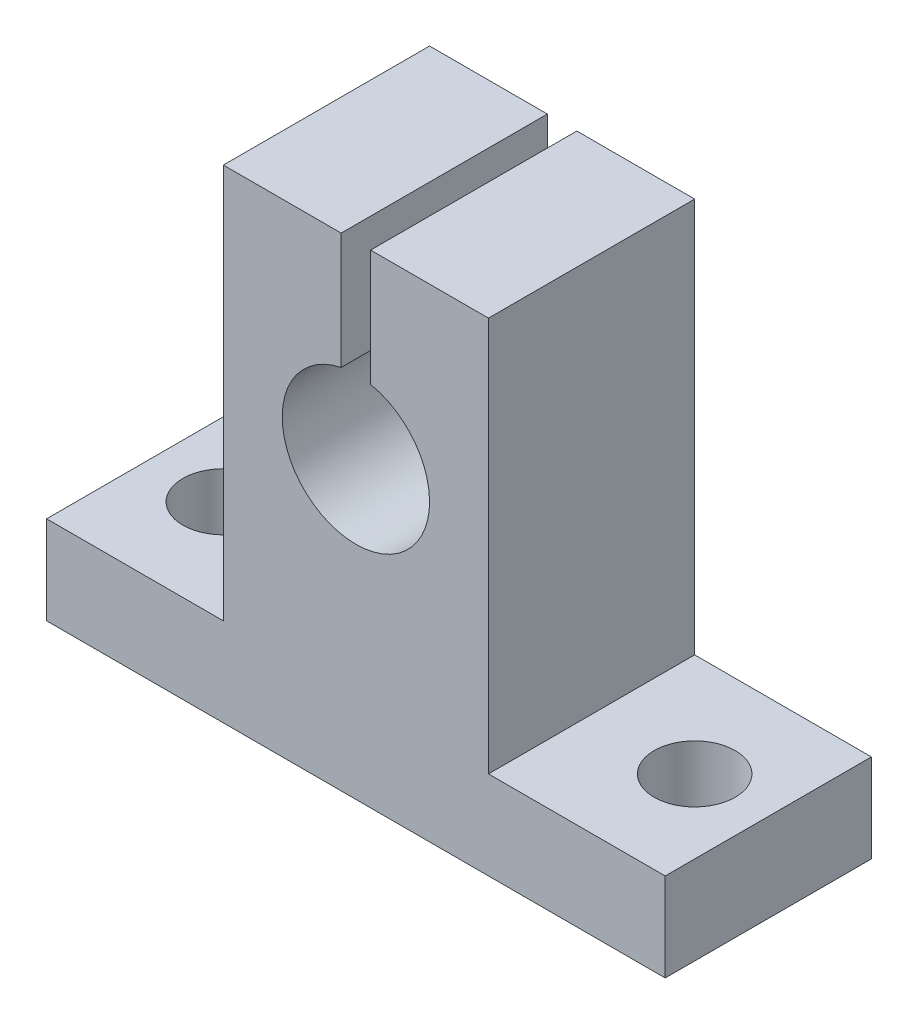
from build123d import *

# Parameters (mm, degrees)
SKIZZE1_W                            = 42
SKIZZE1_H                            = 32.8
AUFSATZ_LINEAR_AUSTRAGEN1_DEPTH      = 14
SKIZZE2_W                            = 12
SKIZZE2_H                            = 26.8
SCHNITT_LINEAR_AUSTRAGEN1_DEPTH      = 33.202484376
SKIZZE3_W                            = 12
SKIZZE3_H                            = 26.8
SCHNITT_LINEAR_AUSTRAGEN2_DEPTH      = 33.202484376
SCHNITT_LINEAR_AUSTRAGEN3_DEPTH      = 33.202484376
SKIZZE5_W                            = 5
SKIZZE5_H                            = 14
F_5_5_5_5_DURCHMESSER_BOHRUNG1_D     = 5.5
F_5_5_5_5_DURCHMESSER_BOHRUNG1_DEPTH = 32.8
F_5_5_5_5_DURCHMESSER_BOHRUNG2_D     = 5.5


with BuildPart() as part:
    # Skizze1 → Aufsatz-Linear austragen1 (new body)
    with BuildSketch(Plane.XY.offset(7)):
        with Locations((0, -3.6)):
            Rectangle(SKIZZE1_W, SKIZZE1_H)
    extrude(amount=-AUFSATZ_LINEAR_AUSTRAGEN1_DEPTH)

    # Skizze2 → Schnitt-Linear austragen1 (cut, through all)
    with BuildSketch(Plane(origin=(0, 0, -7), x_dir=(-1, 0, 0), z_dir=(0, 0, -1))):
        with Locations((15, -0.6)):
            Rectangle(SKIZZE2_W, SKIZZE2_H)
    extrude(amount=-SCHNITT_LINEAR_AUSTRAGEN1_DEPTH, mode=Mode.SUBTRACT)

    # Skizze3 → Schnitt-Linear austragen2 (cut, through all)
    with BuildSketch(Plane(origin=(0, 0, -7), x_dir=(-1, 0, 0), z_dir=(0, 0, -1))):
        with Locations((-15, -0.6)):
            Rectangle(SKIZZE3_W, SKIZZE3_H)
    extrude(amount=-SCHNITT_LINEAR_AUSTRAGEN2_DEPTH, mode=Mode.SUBTRACT)

    # Skizze4 → Schnitt-Linear austragen3 (cut, through all)
    with BuildSketch(Plane(origin=(0, 0, -7), x_dir=(-1, 0, 0), z_dir=(0, 0, -1))):
        with BuildLine():
            Line((1, 12.8), (-1, 12.8))
            Line((-1, 12.8), (-1, 4.898979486))
            ThreePointArc((-1, 4.898979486), (0, 5), (1, 4.898979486))
            Line((1, 4.898979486), (1, 12.8))
        make_face()
    extrude(amount=-SCHNITT_LINEAR_AUSTRAGEN3_DEPTH, mode=Mode.SUBTRACT)

    # Skizze5 → Schnitt-Rotation1 (revolve, cut)
    with BuildSketch(Plane(origin=(0, 0, 0), x_dir=(1, 0, 0), z_dir=(0, 1, 0))):
        with Locations((2.5, 0)):
            Rectangle(SKIZZE5_W, SKIZZE5_H)
    revolve(axis=Axis((0, 0, -7), (0, 0, 1)), mode=Mode.SUBTRACT)

    # 5.5 _5.5_ Durchmesser Bohrung1
    with Locations(Plane(origin=(0, -20, 0), x_dir=(-1, 0, 0), z_dir=(0, -1, 0))):
        with Locations((-16, 0)):
            Hole(F_5_5_5_5_DURCHMESSER_BOHRUNG1_D / 2, depth=F_5_5_5_5_DURCHMESSER_BOHRUNG1_DEPTH)

    # 5.5 _5.5_ Durchmesser Bohrung2 (through all)
    with Locations(Plane(origin=(0, -14, 0), x_dir=(1, 0, 0), z_dir=(0, 1, 0))):
        with Locations((-16, 0)):
            Hole(F_5_5_5_5_DURCHMESSER_BOHRUNG2_D / 2)


solid = part.part
